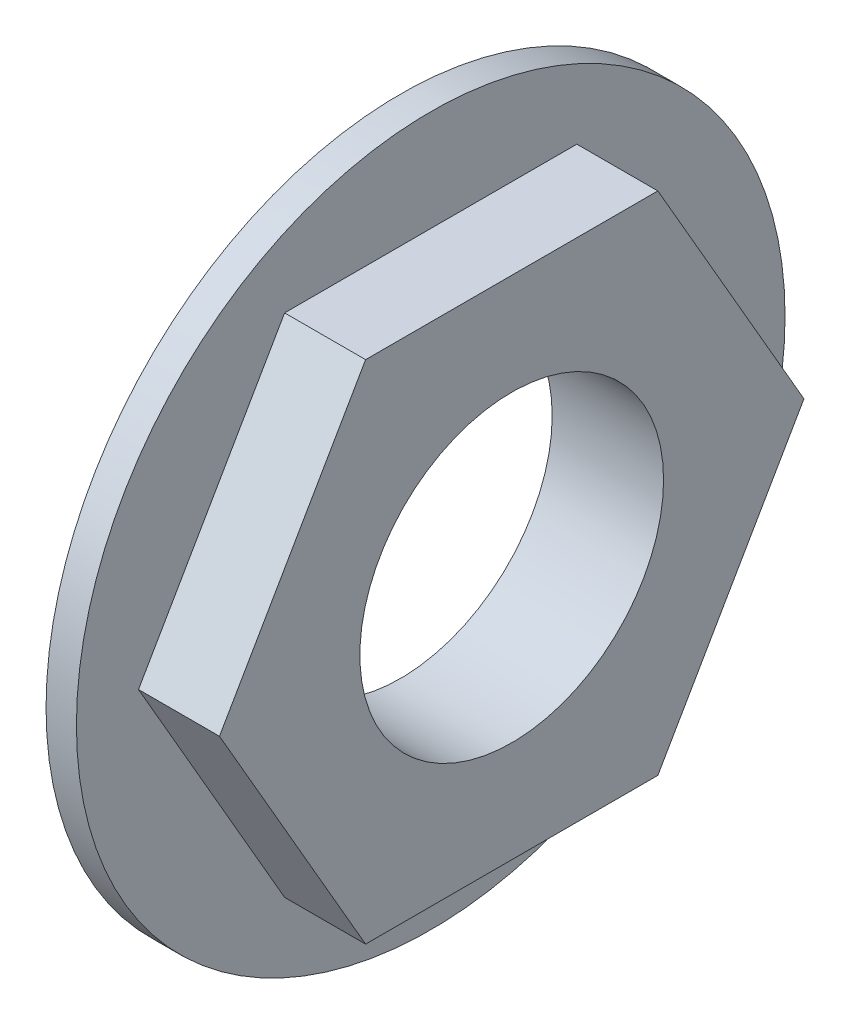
ISO-10303-21;
HEADER;
FILE_DESCRIPTION(('STEP AP214'),'2;1');
FILE_NAME('part.step','',(''),(''),'','','');
FILE_SCHEMA(('AUTOMOTIVE_DESIGN { 1 0 10303 214 1 1 1 1 }'));
ENDSEC;
DATA;
#1=APPLICATION_CONTEXT('core data for automotive mechanical design processes');
#2=APPLICATION_PROTOCOL_DEFINITION('international standard','automotive_design',2000,#1);
#3=PRODUCT_CONTEXT('',#1,'mechanical');
#4=PRODUCT('Part','Part','',(#3));
#5=PRODUCT_RELATED_PRODUCT_CATEGORY('part','',(#4));
#6=PRODUCT_DEFINITION_FORMATION('','',#4);
#7=PRODUCT_DEFINITION_CONTEXT('part definition',#1,'design');
#8=PRODUCT_DEFINITION('design','',#6,#7);
#9=PRODUCT_DEFINITION_SHAPE('','',#8);
#10=(LENGTH_UNIT() NAMED_UNIT(*) SI_UNIT(.MILLI.,.METRE.));
#11=(NAMED_UNIT(*) PLANE_ANGLE_UNIT() SI_UNIT($,.RADIAN.));
#12=(NAMED_UNIT(*) SI_UNIT($,.STERADIAN.) SOLID_ANGLE_UNIT());
#13=UNCERTAINTY_MEASURE_WITH_UNIT(LENGTH_MEASURE(1.E-05),#10,'distance_accuracy_value','');
#14=(GEOMETRIC_REPRESENTATION_CONTEXT(3) GLOBAL_UNCERTAINTY_ASSIGNED_CONTEXT((#13)) GLOBAL_UNIT_ASSIGNED_CONTEXT((#10,
#11,#12)) REPRESENTATION_CONTEXT('',''));
#15=CARTESIAN_POINT('',(0.,0.,0.));
#16=DIRECTION('',(0.,0.,1.));
#17=DIRECTION('',(1.,0.,0.));
#18=AXIS2_PLACEMENT_3D('',#15,#16,#17);
#19=CARTESIAN_POINT('',(1.905,0.,0.));
#20=DIRECTION('',(1.,0.,0.));
#21=DIRECTION('',(0.,0.,-1.));
#22=AXIS2_PLACEMENT_3D('',#19,#20,#21);
#23=PLANE('',#22);
#24=CARTESIAN_POINT('',(1.905,0.,0.));
#25=DIRECTION('',(1.,0.,0.));
#26=DIRECTION('',(0.,0.,-1.));
#27=AXIS2_PLACEMENT_3D('',#24,#25,#26);
#28=CIRCLE('',#27,22.225);
#29=CARTESIAN_POINT('',(1.905,0.,22.225));
#30=VERTEX_POINT('',#29);
#31=EDGE_CURVE('E11',#30,#30,#28,.T.);
#32=ORIENTED_EDGE('',*,*,#31,.T.);
#33=EDGE_LOOP('',(#32));
#34=FACE_BOUND('',#33,.T.);
#35=DIRECTION('',(0.,0.866025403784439,0.5));
#36=VECTOR('',#35,1.);
#37=CARTESIAN_POINT('',(1.905,0.,-18.3308710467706));
#38=LINE('',#37,#36);
#39=CARTESIAN_POINT('',(1.905,0.,-18.3308710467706));
#40=VERTEX_POINT('',#39);
#41=CARTESIAN_POINT('',(1.905,15.875,-9.16543552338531));
#42=VERTEX_POINT('',#41);
#43=EDGE_CURVE('E121',#40,#42,#38,.T.);
#44=ORIENTED_EDGE('',*,*,#43,.F.);
#45=DIRECTION('',(0.,0.866025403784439,-0.5));
#46=VECTOR('',#45,1.);
#47=CARTESIAN_POINT('',(1.905,-15.875,-9.1654355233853));
#48=LINE('',#47,#46);
#49=CARTESIAN_POINT('',(1.905,-15.875,-9.1654355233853));
#50=VERTEX_POINT('',#49);
#51=EDGE_CURVE('E118',#50,#40,#48,.T.);
#52=ORIENTED_EDGE('',*,*,#51,.F.);
#53=DIRECTION('',(0.,0.,-1.));
#54=VECTOR('',#53,1.);
#55=CARTESIAN_POINT('',(1.905,-15.875,9.16543552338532));
#56=LINE('',#55,#54);
#57=CARTESIAN_POINT('',(1.905,-15.875,9.16543552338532));
#58=VERTEX_POINT('',#57);
#59=EDGE_CURVE('E77',#58,#50,#56,.T.);
#60=ORIENTED_EDGE('',*,*,#59,.F.);
#61=DIRECTION('',(0.,-0.866025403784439,-0.5));
#62=VECTOR('',#61,1.);
#63=CARTESIAN_POINT('',(1.905,0.,18.3308710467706));
#64=LINE('',#63,#62);
#65=CARTESIAN_POINT('',(1.905,0.,18.3308710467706));
#66=VERTEX_POINT('',#65);
#67=EDGE_CURVE('E127',#66,#58,#64,.T.);
#68=ORIENTED_EDGE('',*,*,#67,.F.);
#69=DIRECTION('',(0.,-0.866025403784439,0.5));
#70=VECTOR('',#69,1.);
#71=CARTESIAN_POINT('',(1.905,15.875,9.16543552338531));
#72=LINE('',#71,#70);
#73=CARTESIAN_POINT('',(1.905,15.875,9.16543552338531));
#74=VERTEX_POINT('',#73);
#75=EDGE_CURVE('E107',#74,#66,#72,.T.);
#76=ORIENTED_EDGE('',*,*,#75,.F.);
#77=DIRECTION('',(0.,0.,1.));
#78=VECTOR('',#77,1.);
#79=CARTESIAN_POINT('',(1.905,15.875,-9.16543552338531));
#80=LINE('',#79,#78);
#81=EDGE_CURVE('E124',#42,#74,#80,.T.);
#82=ORIENTED_EDGE('',*,*,#81,.F.);
#83=EDGE_LOOP('',(#44,#52,#60,#68,#76,#82));
#84=FACE_BOUND('',#83,.T.);
#85=ADVANCED_FACE('F32',(#34,#84),#23,.T.);
#86=CARTESIAN_POINT('',(1.905,0.,0.));
#87=DIRECTION('',(-1.,0.,0.));
#88=DIRECTION('',(0.,0.,1.));
#89=AXIS2_PLACEMENT_3D('',#86,#87,#88);
#90=CYLINDRICAL_SURFACE('',#89,22.225);
#91=CARTESIAN_POINT('',(0.,0.,0.));
#92=DIRECTION('',(1.,0.,0.));
#93=DIRECTION('',(0.,0.,-1.));
#94=AXIS2_PLACEMENT_3D('',#91,#92,#93);
#95=CIRCLE('',#94,22.225);
#96=CARTESIAN_POINT('',(0.,0.,22.225));
#97=VERTEX_POINT('',#96);
#98=EDGE_CURVE('E41',#97,#97,#95,.T.);
#99=CARTESIAN_POINT('',(1.905,0.,22.225));
#100=CARTESIAN_POINT('',(1.88515625,0.,22.225));
#101=CARTESIAN_POINT('',(1.8653125,0.,22.225));
#102=CARTESIAN_POINT('',(1.825625,0.,22.225));
#103=CARTESIAN_POINT('',(1.80578125,0.,22.225));
#104=CARTESIAN_POINT('',(1.76609375,0.,22.225));
#105=CARTESIAN_POINT('',(1.74625,0.,22.225));
#106=CARTESIAN_POINT('',(1.7065625,0.,22.225));
#107=CARTESIAN_POINT('',(1.68671875,0.,22.225));
#108=CARTESIAN_POINT('',(1.64703125,0.,22.225));
#109=CARTESIAN_POINT('',(1.6271875,0.,22.225));
#110=CARTESIAN_POINT('',(1.5875,0.,22.225));
#111=CARTESIAN_POINT('',(1.56765625,0.,22.225));
#112=CARTESIAN_POINT('',(1.52796875,0.,22.225));
#113=CARTESIAN_POINT('',(1.508125,0.,22.225));
#114=CARTESIAN_POINT('',(1.4684375,0.,22.225));
#115=CARTESIAN_POINT('',(1.44859375,0.,22.225));
#116=CARTESIAN_POINT('',(1.40890625,0.,22.225));
#117=CARTESIAN_POINT('',(1.3890625,0.,22.225));
#118=CARTESIAN_POINT('',(1.349375,0.,22.225));
#119=CARTESIAN_POINT('',(1.32953125,0.,22.225));
#120=CARTESIAN_POINT('',(1.28984375,0.,22.225));
#121=CARTESIAN_POINT('',(1.27,0.,22.225));
#122=CARTESIAN_POINT('',(1.2303125,0.,22.225));
#123=CARTESIAN_POINT('',(1.21046875,0.,22.225));
#124=CARTESIAN_POINT('',(1.17078125,0.,22.225));
#125=CARTESIAN_POINT('',(1.1509375,0.,22.225));
#126=CARTESIAN_POINT('',(1.11125,0.,22.225));
#127=CARTESIAN_POINT('',(1.09140625,0.,22.225));
#128=CARTESIAN_POINT('',(1.05171875,0.,22.225));
#129=CARTESIAN_POINT('',(1.031875,0.,22.225));
#130=CARTESIAN_POINT('',(0.9921875,0.,22.225));
#131=CARTESIAN_POINT('',(0.97234375,0.,22.225));
#132=CARTESIAN_POINT('',(0.93265625,0.,22.225));
#133=CARTESIAN_POINT('',(0.9128125,0.,22.225));
#134=CARTESIAN_POINT('',(0.873125,0.,22.225));
#135=CARTESIAN_POINT('',(0.85328125,0.,22.225));
#136=CARTESIAN_POINT('',(0.81359375,0.,22.225));
#137=CARTESIAN_POINT('',(0.79375,0.,22.225));
#138=CARTESIAN_POINT('',(0.7540625,0.,22.225));
#139=CARTESIAN_POINT('',(0.73421875,0.,22.225));
#140=CARTESIAN_POINT('',(0.69453125,0.,22.225));
#141=CARTESIAN_POINT('',(0.6746875,0.,22.225));
#142=CARTESIAN_POINT('',(0.635,0.,22.225));
#143=CARTESIAN_POINT('',(0.61515625,0.,22.225));
#144=CARTESIAN_POINT('',(0.57546875,0.,22.225));
#145=CARTESIAN_POINT('',(0.555625,0.,22.225));
#146=CARTESIAN_POINT('',(0.5159375,0.,22.225));
#147=CARTESIAN_POINT('',(0.49609375,0.,22.225));
#148=CARTESIAN_POINT('',(0.45640625,0.,22.225));
#149=CARTESIAN_POINT('',(0.4365625,0.,22.225));
#150=CARTESIAN_POINT('',(0.396875,0.,22.225));
#151=CARTESIAN_POINT('',(0.37703125,0.,22.225));
#152=CARTESIAN_POINT('',(0.33734375,0.,22.225));
#153=CARTESIAN_POINT('',(0.3175,0.,22.225));
#154=CARTESIAN_POINT('',(0.2778125,0.,22.225));
#155=CARTESIAN_POINT('',(0.25796875,0.,22.225));
#156=CARTESIAN_POINT('',(0.21828125,0.,22.225));
#157=CARTESIAN_POINT('',(0.1984375,0.,22.225));
#158=CARTESIAN_POINT('',(0.15875,0.,22.225));
#159=CARTESIAN_POINT('',(0.13890625,0.,22.225));
#160=CARTESIAN_POINT('',(0.09921875,0.,22.225));
#161=CARTESIAN_POINT('',(0.0793749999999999,0.,22.225));
#162=CARTESIAN_POINT('',(0.0396874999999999,0.,22.225));
#163=CARTESIAN_POINT('',(0.01984375,0.,22.225));
#164=CARTESIAN_POINT('',(0.,0.,22.225));
#165=B_SPLINE_CURVE_WITH_KNOTS('',3,(#99,#100,#101,#102,#103,#104,#105,#106,#107,#108,#109,#110,
#111,#112,#113,#114,#115,#116,#117,#118,#119,#120,#121,#122,#123,#124,#125,#126,#127,#128,#129,
#130,#131,#132,#133,#134,#135,#136,#137,#138,#139,#140,#141,#142,#143,#144,#145,#146,#147,#148,
#149,#150,#151,#152,#153,#154,#155,#156,#157,#158,#159,#160,#161,#162,#163,#164),.UNSPECIFIED.,
.F.,.F.,(4,2,2,2,2,2,2,2,2,2,2,2,2,2,2,2,2,2,2,2,2,2,2,2,2,2,2,2,2,2,2,2,4),(0.,
0.0595312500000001,0.1190625,0.17859375,0.238125,0.29765625,0.3571875,0.41671875,0.47625,
0.53578125,0.5953125,0.65484375,0.714375,0.77390625,0.8334375,0.89296875,0.9525,1.01203125,
1.0715625,1.13109375,1.190625,1.25015625,1.3096875,1.36921875,1.42875,1.48828125,1.5478125,
1.60734375,1.666875,1.72640625,1.7859375,1.84546875,1.905),.UNSPECIFIED.);
#166=EDGE_CURVE('BSEAM34',#30,#97,#165,.T.);
#167=ORIENTED_EDGE('',*,*,#31,.F.);
#168=ORIENTED_EDGE('',*,*,#98,.T.);
#169=ORIENTED_EDGE('',*,*,#166,.T.);
#170=ORIENTED_EDGE('',*,*,#166,.F.);
#171=EDGE_LOOP('',(#167,#169,#168,#170));
#172=FACE_BOUND('',#171,.T.);
#173=ADVANCED_FACE('F34',(#172),#90,.T.);
#174=CARTESIAN_POINT('',(0.,0.,0.));
#175=DIRECTION('',(1.,0.,0.));
#176=DIRECTION('',(0.,0.,-1.));
#177=AXIS2_PLACEMENT_3D('',#174,#175,#176);
#178=PLANE('',#177);
#179=CARTESIAN_POINT('',(0.,0.,0.));
#180=DIRECTION('',(1.,0.,0.));
#181=DIRECTION('',(0.,0.,-1.));
#182=AXIS2_PLACEMENT_3D('',#179,#180,#181);
#183=CIRCLE('',#182,9.525);
#184=CARTESIAN_POINT('',(0.,0.,-9.525));
#185=VERTEX_POINT('',#184);
#186=EDGE_CURVE('E122',#185,#185,#183,.T.);
#187=ORIENTED_EDGE('',*,*,#186,.T.);
#188=EDGE_LOOP('',(#187));
#189=FACE_BOUND('',#188,.T.);
#190=ORIENTED_EDGE('',*,*,#98,.F.);
#191=EDGE_LOOP('',(#190));
#192=FACE_BOUND('',#191,.T.);
#193=ADVANCED_FACE('F142',(#189,#192),#178,.F.);
#194=CARTESIAN_POINT('',(6.985,-15.875,-9.1654355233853));
#195=DIRECTION('',(0.,0.5,0.866025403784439));
#196=DIRECTION('',(0.,-0.866025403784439,0.5));
#197=AXIS2_PLACEMENT_3D('',#194,#195,#196);
#198=PLANE('',#197);
#199=ORIENTED_EDGE('',*,*,#51,.T.);
#200=DIRECTION('',(-1.,0.,0.));
#201=VECTOR('',#200,1.);
#202=CARTESIAN_POINT('',(6.985,0.,-18.3308710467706));
#203=LINE('',#202,#201);
#204=CARTESIAN_POINT('',(6.985,0.,-18.3308710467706));
#205=VERTEX_POINT('',#204);
#206=EDGE_CURVE('E137',#205,#40,#203,.T.);
#207=ORIENTED_EDGE('',*,*,#206,.F.);
#208=DIRECTION('',(0.,0.866025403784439,-0.5));
#209=VECTOR('',#208,1.);
#210=CARTESIAN_POINT('',(6.985,-15.875,-9.1654355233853));
#211=LINE('',#210,#209);
#212=CARTESIAN_POINT('',(6.985,-15.875,-9.1654355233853));
#213=VERTEX_POINT('',#212);
#214=EDGE_CURVE('E130',#213,#205,#211,.T.);
#215=ORIENTED_EDGE('',*,*,#214,.F.);
#216=DIRECTION('',(-1.,0.,0.));
#217=VECTOR('',#216,1.);
#218=CARTESIAN_POINT('',(6.985,-15.875,-9.1654355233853));
#219=LINE('',#218,#217);
#220=EDGE_CURVE('E114',#213,#50,#219,.T.);
#221=ORIENTED_EDGE('',*,*,#220,.T.);
#222=EDGE_LOOP('',(#199,#207,#215,#221));
#223=FACE_BOUND('',#222,.T.);
#224=ADVANCED_FACE('F144',(#223),#198,.F.);
#225=CARTESIAN_POINT('',(6.985,0.,-18.3308710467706));
#226=DIRECTION('',(0.,-0.5,0.866025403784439));
#227=DIRECTION('',(0.,-0.866025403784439,-0.5));
#228=AXIS2_PLACEMENT_3D('',#225,#226,#227);
#229=PLANE('',#228);
#230=ORIENTED_EDGE('',*,*,#43,.T.);
#231=DIRECTION('',(-1.,0.,0.));
#232=VECTOR('',#231,1.);
#233=CARTESIAN_POINT('',(6.985,15.875,-9.16543552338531));
#234=LINE('',#233,#232);
#235=CARTESIAN_POINT('',(6.985,15.875,-9.16543552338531));
#236=VERTEX_POINT('',#235);
#237=EDGE_CURVE('E134',#236,#42,#234,.T.);
#238=ORIENTED_EDGE('',*,*,#237,.F.);
#239=DIRECTION('',(0.,0.866025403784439,0.5));
#240=VECTOR('',#239,1.);
#241=CARTESIAN_POINT('',(6.985,0.,-18.3308710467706));
#242=LINE('',#241,#240);
#243=EDGE_CURVE('E85',#205,#236,#242,.T.);
#244=ORIENTED_EDGE('',*,*,#243,.F.);
#245=ORIENTED_EDGE('',*,*,#206,.T.);
#246=EDGE_LOOP('',(#230,#238,#244,#245));
#247=FACE_BOUND('',#246,.T.);
#248=ADVANCED_FACE('F150',(#247),#229,.F.);
#249=CARTESIAN_POINT('',(6.985,15.875,-9.16543552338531));
#250=DIRECTION('',(0.,-1.,0.));
#251=DIRECTION('',(0.,0.,-1.));
#252=AXIS2_PLACEMENT_3D('',#249,#250,#251);
#253=PLANE('',#252);
#254=ORIENTED_EDGE('',*,*,#81,.T.);
#255=DIRECTION('',(-1.,0.,0.));
#256=VECTOR('',#255,1.);
#257=CARTESIAN_POINT('',(6.985,15.875,9.16543552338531));
#258=LINE('',#257,#256);
#259=CARTESIAN_POINT('',(6.985,15.875,9.16543552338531));
#260=VERTEX_POINT('',#259);
#261=EDGE_CURVE('E110',#260,#74,#258,.T.);
#262=ORIENTED_EDGE('',*,*,#261,.F.);
#263=DIRECTION('',(0.,0.,1.));
#264=VECTOR('',#263,1.);
#265=CARTESIAN_POINT('',(6.985,15.875,-9.16543552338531));
#266=LINE('',#265,#264);
#267=EDGE_CURVE('E98',#236,#260,#266,.T.);
#268=ORIENTED_EDGE('',*,*,#267,.F.);
#269=ORIENTED_EDGE('',*,*,#237,.T.);
#270=EDGE_LOOP('',(#254,#262,#268,#269));
#271=FACE_BOUND('',#270,.T.);
#272=ADVANCED_FACE('F164',(#271),#253,.F.);
#273=CARTESIAN_POINT('',(6.985,15.875,9.16543552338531));
#274=DIRECTION('',(0.,-0.5,-0.866025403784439));
#275=DIRECTION('',(0.,0.866025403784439,-0.5));
#276=AXIS2_PLACEMENT_3D('',#273,#274,#275);
#277=PLANE('',#276);
#278=ORIENTED_EDGE('',*,*,#75,.T.);
#279=DIRECTION('',(-1.,0.,0.));
#280=VECTOR('',#279,1.);
#281=CARTESIAN_POINT('',(6.985,0.,18.3308710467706));
#282=LINE('',#281,#280);
#283=CARTESIAN_POINT('',(6.985,0.,18.3308710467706));
#284=VERTEX_POINT('',#283);
#285=EDGE_CURVE('E104',#284,#66,#282,.T.);
#286=ORIENTED_EDGE('',*,*,#285,.F.);
#287=DIRECTION('',(0.,-0.866025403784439,0.5));
#288=VECTOR('',#287,1.);
#289=CARTESIAN_POINT('',(6.985,15.875,9.16543552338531));
#290=LINE('',#289,#288);
#291=EDGE_CURVE('E92',#260,#284,#290,.T.);
#292=ORIENTED_EDGE('',*,*,#291,.F.);
#293=ORIENTED_EDGE('',*,*,#261,.T.);
#294=EDGE_LOOP('',(#278,#286,#292,#293));
#295=FACE_BOUND('',#294,.T.);
#296=ADVANCED_FACE('F105',(#295),#277,.F.);
#297=CARTESIAN_POINT('',(6.985,0.,18.3308710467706));
#298=DIRECTION('',(0.,0.5,-0.866025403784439));
#299=DIRECTION('',(0.,0.866025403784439,0.5));
#300=AXIS2_PLACEMENT_3D('',#297,#298,#299);
#301=PLANE('',#300);
#302=ORIENTED_EDGE('',*,*,#67,.T.);
#303=DIRECTION('',(-1.,0.,0.));
#304=VECTOR('',#303,1.);
#305=CARTESIAN_POINT('',(6.985,-15.875,9.16543552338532));
#306=LINE('',#305,#304);
#307=CARTESIAN_POINT('',(6.985,-15.875,9.16543552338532));
#308=VERTEX_POINT('',#307);
#309=EDGE_CURVE('E49',#308,#58,#306,.T.);
#310=ORIENTED_EDGE('',*,*,#309,.F.);
#311=DIRECTION('',(0.,-0.866025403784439,-0.5));
#312=VECTOR('',#311,1.);
#313=CARTESIAN_POINT('',(6.985,0.,18.3308710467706));
#314=LINE('',#313,#312);
#315=EDGE_CURVE('E96',#284,#308,#314,.T.);
#316=ORIENTED_EDGE('',*,*,#315,.F.);
#317=ORIENTED_EDGE('',*,*,#285,.T.);
#318=EDGE_LOOP('',(#302,#310,#316,#317));
#319=FACE_BOUND('',#318,.T.);
#320=ADVANCED_FACE('F112',(#319),#301,.F.);
#321=CARTESIAN_POINT('',(6.985,-15.875,9.16543552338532));
#322=DIRECTION('',(0.,1.,0.));
#323=DIRECTION('',(0.,0.,1.));
#324=AXIS2_PLACEMENT_3D('',#321,#322,#323);
#325=PLANE('',#324);
#326=ORIENTED_EDGE('',*,*,#59,.T.);
#327=ORIENTED_EDGE('',*,*,#220,.F.);
#328=DIRECTION('',(0.,0.,-1.));
#329=VECTOR('',#328,1.);
#330=CARTESIAN_POINT('',(6.985,-15.875,9.16543552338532));
#331=LINE('',#330,#329);
#332=EDGE_CURVE('E57',#308,#213,#331,.T.);
#333=ORIENTED_EDGE('',*,*,#332,.F.);
#334=ORIENTED_EDGE('',*,*,#309,.T.);
#335=EDGE_LOOP('',(#326,#327,#333,#334));
#336=FACE_BOUND('',#335,.T.);
#337=ADVANCED_FACE('F172',(#336),#325,.F.);
#338=CARTESIAN_POINT('',(6.985,0.,-18.3308710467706));
#339=DIRECTION('',(1.,0.,0.));
#340=DIRECTION('',(0.,0.,-1.));
#341=AXIS2_PLACEMENT_3D('',#338,#339,#340);
#342=PLANE('',#341);
#343=CARTESIAN_POINT('',(6.985,0.,0.));
#344=DIRECTION('',(1.,0.,0.));
#345=DIRECTION('',(0.,0.,-1.));
#346=AXIS2_PLACEMENT_3D('',#343,#344,#345);
#347=CIRCLE('',#346,9.525);
#348=CARTESIAN_POINT('',(6.985,0.,-9.525));
#349=VERTEX_POINT('',#348);
#350=EDGE_CURVE('E36',#349,#349,#347,.T.);
#351=ORIENTED_EDGE('',*,*,#350,.F.);
#352=EDGE_LOOP('',(#351));
#353=FACE_BOUND('',#352,.T.);
#354=ORIENTED_EDGE('',*,*,#214,.T.);
#355=ORIENTED_EDGE('',*,*,#243,.T.);
#356=ORIENTED_EDGE('',*,*,#267,.T.);
#357=ORIENTED_EDGE('',*,*,#291,.T.);
#358=ORIENTED_EDGE('',*,*,#315,.T.);
#359=ORIENTED_EDGE('',*,*,#332,.T.);
#360=EDGE_LOOP('',(#354,#355,#356,#357,#358,#359));
#361=FACE_BOUND('',#360,.T.);
#362=ADVANCED_FACE('F94',(#353,#361),#342,.T.);
#363=CARTESIAN_POINT('',(-4.445,0.,0.));
#364=DIRECTION('',(1.,0.,0.));
#365=DIRECTION('',(0.,0.,-1.));
#366=AXIS2_PLACEMENT_3D('',#363,#364,#365);
#367=CYLINDRICAL_SURFACE('',#366,9.525);
#368=ORIENTED_EDGE('',*,*,#350,.T.);
#369=EDGE_LOOP('',(#368));
#370=FACE_BOUND('',#369,.T.);
#371=ORIENTED_EDGE('',*,*,#186,.F.);
#372=EDGE_LOOP('',(#371));
#373=FACE_BOUND('',#372,.T.);
#374=ADVANCED_FACE('F177',(#370,#373),#367,.F.);
#375=CLOSED_SHELL('',(#85,#173,#193,#224,#248,#272,#296,#320,#337,#362,#374));
#376=MANIFOLD_SOLID_BREP('B2',#375);
#377=ADVANCED_BREP_SHAPE_REPRESENTATION('',(#18,#376),#14);
#378=SHAPE_DEFINITION_REPRESENTATION(#9,#377);
ENDSEC;
END-ISO-10303-21;
